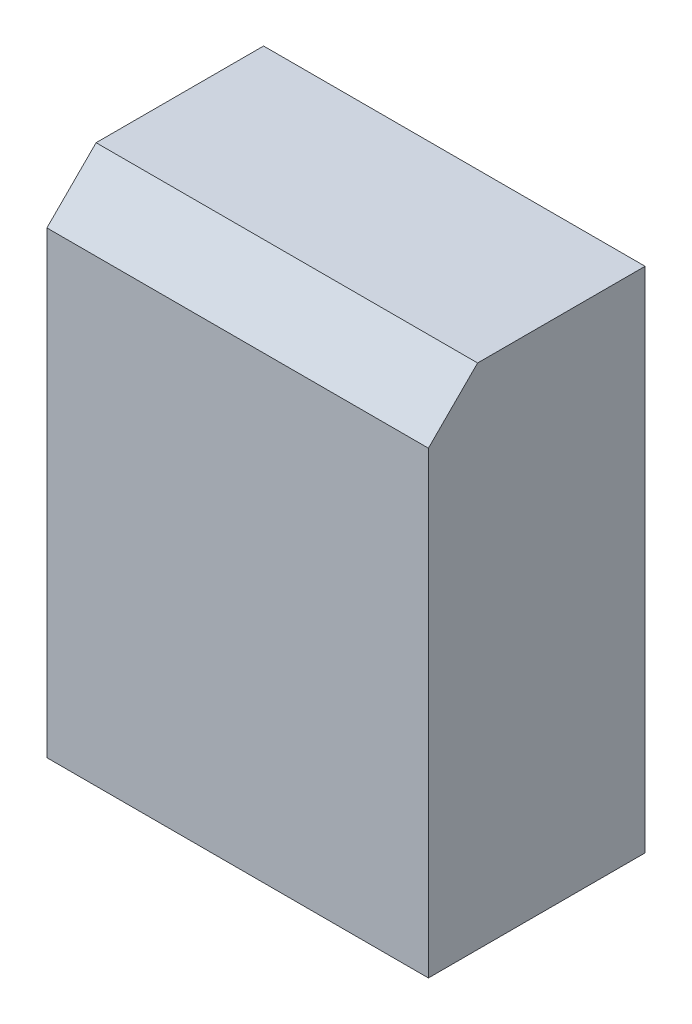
ISO-10303-21;
HEADER;
FILE_DESCRIPTION(('STEP AP214'),'2;1');
FILE_NAME('part.step','',(''),(''),'','','');
FILE_SCHEMA(('AUTOMOTIVE_DESIGN { 1 0 10303 214 1 1 1 1 }'));
ENDSEC;
DATA;
#1=APPLICATION_CONTEXT('core data for automotive mechanical design processes');
#2=APPLICATION_PROTOCOL_DEFINITION('international standard','automotive_design',2000,#1);
#3=PRODUCT_CONTEXT('',#1,'mechanical');
#4=PRODUCT('Part','Part','',(#3));
#5=PRODUCT_RELATED_PRODUCT_CATEGORY('part','',(#4));
#6=PRODUCT_DEFINITION_FORMATION('','',#4);
#7=PRODUCT_DEFINITION_CONTEXT('part definition',#1,'design');
#8=PRODUCT_DEFINITION('design','',#6,#7);
#9=PRODUCT_DEFINITION_SHAPE('','',#8);
#10=(LENGTH_UNIT() NAMED_UNIT(*) SI_UNIT(.MILLI.,.METRE.));
#11=(NAMED_UNIT(*) PLANE_ANGLE_UNIT() SI_UNIT($,.RADIAN.));
#12=(NAMED_UNIT(*) SI_UNIT($,.STERADIAN.) SOLID_ANGLE_UNIT());
#13=UNCERTAINTY_MEASURE_WITH_UNIT(LENGTH_MEASURE(1.E-05),#10,'distance_accuracy_value','');
#14=(GEOMETRIC_REPRESENTATION_CONTEXT(3) GLOBAL_UNCERTAINTY_ASSIGNED_CONTEXT((#13)) GLOBAL_UNIT_ASSIGNED_CONTEXT((#10,
#11,#12)) REPRESENTATION_CONTEXT('',''));
#15=CARTESIAN_POINT('',(0.,0.,0.));
#16=DIRECTION('',(0.,0.,1.));
#17=DIRECTION('',(1.,0.,0.));
#18=AXIS2_PLACEMENT_3D('',#15,#16,#17);
#19=CARTESIAN_POINT('',(-32.7001570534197,103.285343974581,-16.6203277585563));
#20=DIRECTION('',(1.,0.,0.));
#21=DIRECTION('',(0.,0.,-1.));
#22=AXIS2_PLACEMENT_3D('',#19,#20,#21);
#23=PLANE('',#22);
#24=DIRECTION('',(0.,-1.,0.));
#25=VECTOR('',#24,1.);
#26=CARTESIAN_POINT('',(-32.7001570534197,103.285343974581,27.430297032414));
#27=LINE('',#26,#25);
#28=CARTESIAN_POINT('',(-32.7001570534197,93.2853439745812,27.430297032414));
#29=VERTEX_POINT('',#28);
#30=CARTESIAN_POINT('',(-32.7001570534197,0.,27.430297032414));
#31=VERTEX_POINT('',#30);
#32=EDGE_CURVE('E123',#29,#31,#27,.T.);
#33=ORIENTED_EDGE('',*,*,#32,.F.);
#34=DIRECTION('',(0.,0.707106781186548,-0.707106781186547));
#35=VECTOR('',#34,1.);
#36=CARTESIAN_POINT('',(-32.7001570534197,103.285343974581,17.430297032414));
#37=LINE('',#36,#35);
#38=CARTESIAN_POINT('',(-32.7001570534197,103.285343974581,17.430297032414));
#39=VERTEX_POINT('',#38);
#40=EDGE_CURVE('E11',#29,#39,#37,.T.);
#41=ORIENTED_EDGE('',*,*,#40,.T.);
#42=DIRECTION('',(0.,0.,1.));
#43=VECTOR('',#42,1.);
#44=CARTESIAN_POINT('',(-32.7001570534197,103.285343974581,-16.6203277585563));
#45=LINE('',#44,#43);
#46=CARTESIAN_POINT('',(-32.7001570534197,103.285343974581,-16.6203277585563));
#47=VERTEX_POINT('',#46);
#48=EDGE_CURVE('E94',#47,#39,#45,.T.);
#49=ORIENTED_EDGE('',*,*,#48,.F.);
#50=DIRECTION('',(0.,-1.,0.));
#51=VECTOR('',#50,1.);
#52=CARTESIAN_POINT('',(-32.7001570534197,103.285343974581,-16.6203277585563));
#53=LINE('',#52,#51);
#54=CARTESIAN_POINT('',(-32.7001570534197,0.,-16.6203277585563));
#55=VERTEX_POINT('',#54);
#56=EDGE_CURVE('E104',#47,#55,#53,.T.);
#57=ORIENTED_EDGE('',*,*,#56,.T.);
#58=DIRECTION('',(0.,0.,1.));
#59=VECTOR('',#58,1.);
#60=CARTESIAN_POINT('',(-32.7001570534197,0.,-16.6203277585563));
#61=LINE('',#60,#59);
#62=EDGE_CURVE('E113',#55,#31,#61,.T.);
#63=ORIENTED_EDGE('',*,*,#62,.T.);
#64=EDGE_LOOP('',(#33,#41,#49,#57,#63));
#65=FACE_BOUND('',#64,.T.);
#66=ADVANCED_FACE('F40',(#65),#23,.F.);
#67=CARTESIAN_POINT('',(-32.7001570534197,103.285343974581,27.430297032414));
#68=DIRECTION('',(0.,0.,-1.));
#69=DIRECTION('',(-1.,0.,0.));
#70=AXIS2_PLACEMENT_3D('',#67,#68,#69);
#71=PLANE('',#70);
#72=DIRECTION('',(0.,-1.,0.));
#73=VECTOR('',#72,1.);
#74=CARTESIAN_POINT('',(44.8613724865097,103.285343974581,27.430297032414));
#75=LINE('',#74,#73);
#76=CARTESIAN_POINT('',(44.8613724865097,93.2853439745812,27.430297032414));
#77=VERTEX_POINT('',#76);
#78=CARTESIAN_POINT('',(44.8613724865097,0.,27.430297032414));
#79=VERTEX_POINT('',#78);
#80=EDGE_CURVE('E103',#77,#79,#75,.T.);
#81=ORIENTED_EDGE('',*,*,#80,.F.);
#82=DIRECTION('',(-1.,0.,0.));
#83=VECTOR('',#82,1.);
#84=CARTESIAN_POINT('',(-32.7001570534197,93.2853439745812,27.430297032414));
#85=LINE('',#84,#83);
#86=EDGE_CURVE('E49',#77,#29,#85,.T.);
#87=ORIENTED_EDGE('',*,*,#86,.T.);
#88=ORIENTED_EDGE('',*,*,#32,.T.);
#89=DIRECTION('',(1.,0.,0.));
#90=VECTOR('',#89,1.);
#91=CARTESIAN_POINT('',(-32.7001570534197,0.,27.430297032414));
#92=LINE('',#91,#90);
#93=EDGE_CURVE('E116',#31,#79,#92,.T.);
#94=ORIENTED_EDGE('',*,*,#93,.T.);
#95=EDGE_LOOP('',(#81,#87,#88,#94));
#96=FACE_BOUND('',#95,.T.);
#97=ADVANCED_FACE('F127',(#96),#71,.F.);
#98=CARTESIAN_POINT('',(44.8613724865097,103.285343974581,-16.6203277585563));
#99=DIRECTION('',(-1.,0.,0.));
#100=DIRECTION('',(0.,0.,1.));
#101=AXIS2_PLACEMENT_3D('',#98,#99,#100);
#102=PLANE('',#101);
#103=DIRECTION('',(0.,0.,-1.));
#104=VECTOR('',#103,1.);
#105=CARTESIAN_POINT('',(44.8613724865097,103.285343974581,-16.6203277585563));
#106=LINE('',#105,#104);
#107=CARTESIAN_POINT('',(44.8613724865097,103.285343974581,17.430297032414));
#108=VERTEX_POINT('',#107);
#109=CARTESIAN_POINT('',(44.8613724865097,103.285343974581,-16.6203277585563));
#110=VERTEX_POINT('',#109);
#111=EDGE_CURVE('E85',#108,#110,#106,.T.);
#112=ORIENTED_EDGE('',*,*,#111,.F.);
#113=DIRECTION('',(0.,-0.707106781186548,0.707106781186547));
#114=VECTOR('',#113,1.);
#115=CARTESIAN_POINT('',(44.8613724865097,103.285343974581,17.430297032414));
#116=LINE('',#115,#114);
#117=EDGE_CURVE('E63',#108,#77,#116,.T.);
#118=ORIENTED_EDGE('',*,*,#117,.T.);
#119=ORIENTED_EDGE('',*,*,#80,.T.);
#120=DIRECTION('',(0.,0.,-1.));
#121=VECTOR('',#120,1.);
#122=CARTESIAN_POINT('',(44.8613724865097,0.,-16.6203277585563));
#123=LINE('',#122,#121);
#124=CARTESIAN_POINT('',(44.8613724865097,0.,-16.6203277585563));
#125=VERTEX_POINT('',#124);
#126=EDGE_CURVE('E100',#79,#125,#123,.T.);
#127=ORIENTED_EDGE('',*,*,#126,.T.);
#128=DIRECTION('',(0.,-1.,0.));
#129=VECTOR('',#128,1.);
#130=CARTESIAN_POINT('',(44.8613724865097,103.285343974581,-16.6203277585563));
#131=LINE('',#130,#129);
#132=EDGE_CURVE('E97',#110,#125,#131,.T.);
#133=ORIENTED_EDGE('',*,*,#132,.F.);
#134=EDGE_LOOP('',(#112,#118,#119,#127,#133));
#135=FACE_BOUND('',#134,.T.);
#136=ADVANCED_FACE('F98',(#135),#102,.F.);
#137=CARTESIAN_POINT('',(-32.7001570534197,103.285343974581,-16.6203277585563));
#138=DIRECTION('',(0.,0.,1.));
#139=DIRECTION('',(1.,0.,0.));
#140=AXIS2_PLACEMENT_3D('',#137,#138,#139);
#141=PLANE('',#140);
#142=DIRECTION('',(-1.,0.,0.));
#143=VECTOR('',#142,1.);
#144=CARTESIAN_POINT('',(-32.7001570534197,0.,-16.6203277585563));
#145=LINE('',#144,#143);
#146=EDGE_CURVE('E120',#125,#55,#145,.T.);
#147=ORIENTED_EDGE('',*,*,#146,.T.);
#148=ORIENTED_EDGE('',*,*,#56,.F.);
#149=DIRECTION('',(-1.,0.,0.));
#150=VECTOR('',#149,1.);
#151=CARTESIAN_POINT('',(-32.7001570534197,103.285343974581,-16.6203277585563));
#152=LINE('',#151,#150);
#153=EDGE_CURVE('E90',#110,#47,#152,.T.);
#154=ORIENTED_EDGE('',*,*,#153,.F.);
#155=ORIENTED_EDGE('',*,*,#132,.T.);
#156=EDGE_LOOP('',(#147,#148,#154,#155));
#157=FACE_BOUND('',#156,.T.);
#158=ADVANCED_FACE('F106',(#157),#141,.F.);
#159=CARTESIAN_POINT('',(0.,103.285343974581,0.));
#160=DIRECTION('',(0.,1.,0.));
#161=DIRECTION('',(0.,0.,1.));
#162=AXIS2_PLACEMENT_3D('',#159,#160,#161);
#163=PLANE('',#162);
#164=ORIENTED_EDGE('',*,*,#48,.T.);
#165=DIRECTION('',(1.,0.,0.));
#166=VECTOR('',#165,1.);
#167=CARTESIAN_POINT('',(44.8613724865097,103.285343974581,17.430297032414));
#168=LINE('',#167,#166);
#169=EDGE_CURVE('E93',#39,#108,#168,.T.);
#170=ORIENTED_EDGE('',*,*,#169,.T.);
#171=ORIENTED_EDGE('',*,*,#111,.T.);
#172=ORIENTED_EDGE('',*,*,#153,.T.);
#173=EDGE_LOOP('',(#164,#170,#171,#172));
#174=FACE_BOUND('',#173,.T.);
#175=ADVANCED_FACE('F88',(#174),#163,.T.);
#176=CARTESIAN_POINT('',(0.,0.,0.));
#177=DIRECTION('',(0.,1.,0.));
#178=DIRECTION('',(0.,0.,1.));
#179=AXIS2_PLACEMENT_3D('',#176,#177,#178);
#180=PLANE('',#179);
#181=ORIENTED_EDGE('',*,*,#62,.F.);
#182=ORIENTED_EDGE('',*,*,#146,.F.);
#183=ORIENTED_EDGE('',*,*,#126,.F.);
#184=ORIENTED_EDGE('',*,*,#93,.F.);
#185=EDGE_LOOP('',(#181,#182,#183,#184));
#186=FACE_BOUND('',#185,.T.);
#187=ADVANCED_FACE('F132',(#186),#180,.F.);
#188=CARTESIAN_POINT('',(0.,103.285343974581,17.430297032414));
#189=DIRECTION('',(0.,0.707106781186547,0.707106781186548));
#190=DIRECTION('',(-1.,0.,0.));
#191=AXIS2_PLACEMENT_3D('',#188,#189,#190);
#192=PLANE('',#191);
#193=ORIENTED_EDGE('',*,*,#40,.F.);
#194=ORIENTED_EDGE('',*,*,#86,.F.);
#195=ORIENTED_EDGE('',*,*,#117,.F.);
#196=ORIENTED_EDGE('',*,*,#169,.F.);
#197=EDGE_LOOP('',(#193,#194,#195,#196));
#198=FACE_BOUND('',#197,.T.);
#199=ADVANCED_FACE('F43',(#198),#192,.T.);
#200=CLOSED_SHELL('',(#66,#97,#136,#158,#175,#187,#199));
#201=MANIFOLD_SOLID_BREP('B2',#200);
#202=ADVANCED_BREP_SHAPE_REPRESENTATION('',(#18,#201),#14);
#203=SHAPE_DEFINITION_REPRESENTATION(#9,#202);
ENDSEC;
END-ISO-10303-21;
